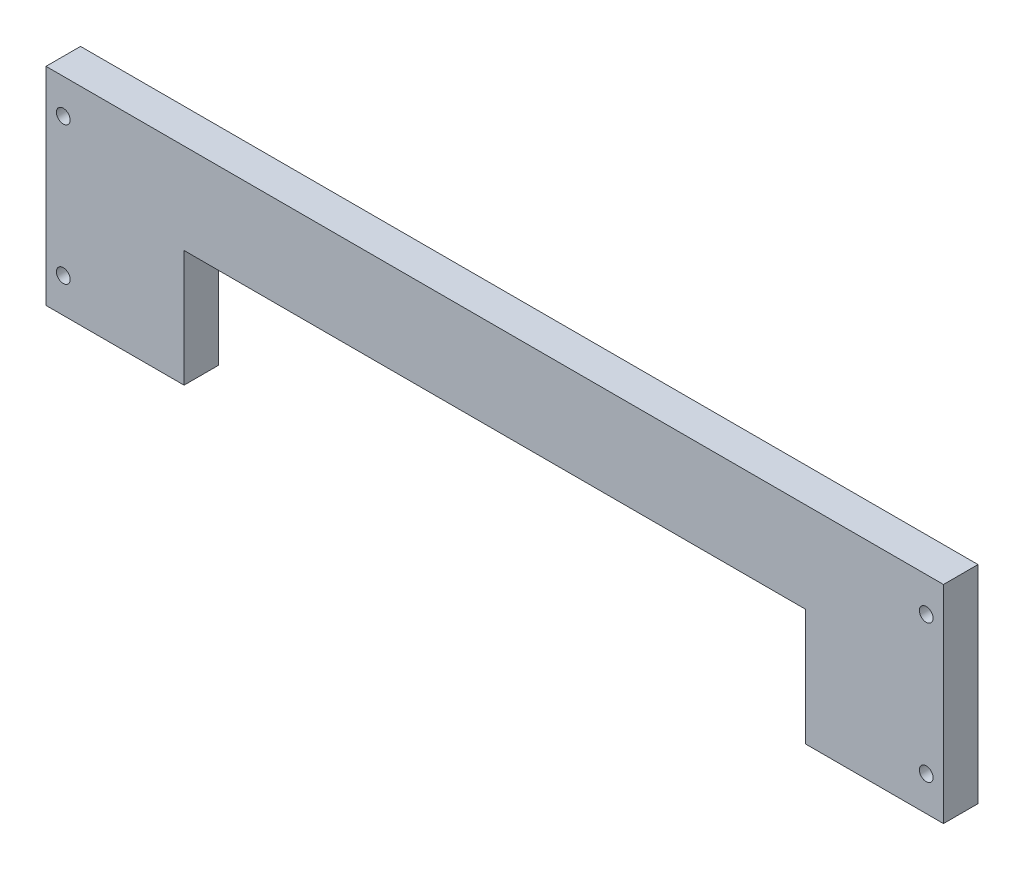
from build123d import *

# Parameters (mm, degrees)
SKETCH1_W                            = 330.2
SKETCH1_H                            = 76.2
BOSS_EXTRUDE1_DEPTH                  = 12.7
SKETCH3_W                            = 228.6
SKETCH3_H                            = 42.926
CUT_EXTRUDE1_DEPTH                   = 12.7
F_8_0_199_DIAMETER_HOLE1_D           = 5.0546
F_8_0_199_DIAMETER_HOLE1_CSINK_D     = 9.2075
F_8_0_199_DIAMETER_HOLE1_CSINK_ANGLE = 90


with BuildPart() as part:
    # Sketch1 → Boss-Extrude1 (new body)
    with BuildSketch(Plane.XY):
        with Locations((88.632927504, -6.888950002)):
            Rectangle(SKETCH1_W, SKETCH1_H)
    extrude(amount=BOSS_EXTRUDE1_DEPTH)

    # Sketch3 → Cut-Extrude1 (cut)
    with BuildSketch(Plane(origin=(0, 0, 0), x_dir=(-1, 0, 0), z_dir=(0, 0, -1))):
        with Locations((-88.632927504, -23.525950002)):
            Rectangle(SKETCH3_W, SKETCH3_H)
    extrude(amount=-CUT_EXTRUDE1_DEPTH, mode=Mode.SUBTRACT)

    # 8 _0.199_ Diameter Hole1 (through all)
    with Locations(Plane(origin=(0, 0, 0), x_dir=(-1, 0, 0), z_dir=(0, 0, -1))):
        with Locations((-247.382927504, 18.511049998), (-247.382927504, -32.288950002), (70.117072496, 18.511049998), (70.117072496, -32.288950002)):
            CounterSinkHole(F_8_0_199_DIAMETER_HOLE1_D / 2, F_8_0_199_DIAMETER_HOLE1_CSINK_D / 2, counter_sink_angle=F_8_0_199_DIAMETER_HOLE1_CSINK_ANGLE)


solid = part.part
